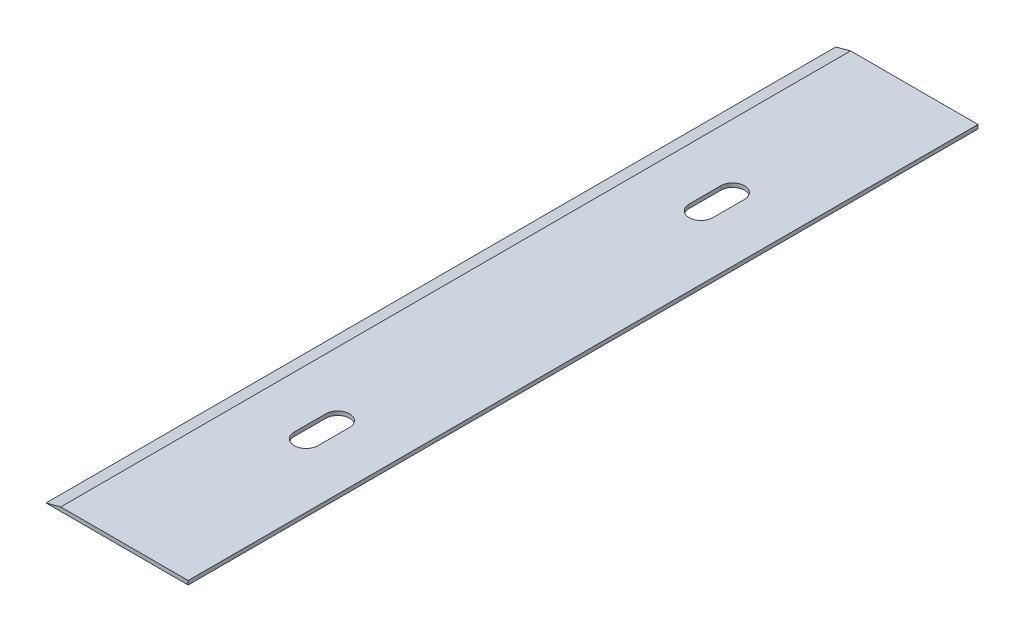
from build123d import *

# Parameters (mm, degrees)
SALIENTE_EXTRUIR1_DEPTH = 100
CORTAR_EXTRUIR1_DEPTH   = 102.608316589


with BuildPart() as part:
    # Croquis1 → Saliente-Extruir1 (new body)
    with BuildSketch(Plane.XY):
        Polygon((0, 0), (1.866025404, 0.5), (18, 0.5), (18, 0), align=None)
    extrude(amount=-SALIENTE_EXTRUIR1_DEPTH)

    # Croquis2 → Cortar-Extruir1 (cut, through all)
    with BuildSketch(Plane(origin=(0, 0.5, 0), x_dir=(1, 0, 0), z_dir=(0, 1, 0))):
        with BuildLine():
            Line((11.433012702, 77), (11.433012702, 73))
            ThreePointArc((11.433012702, 73), (9.933012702, 71.5), (8.433012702, 73))
            Line((8.433012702, 73), (8.433012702, 77))
            ThreePointArc((8.433012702, 77), (9.933012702, 78.5), (11.433012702, 77))
        make_face()
    cortar_extruir1 = extrude(amount=-CORTAR_EXTRUIR1_DEPTH, mode=Mode.SUBTRACT)

    # Simetr_a1: Cortar-Extruir1 across plane
    add(cortar_extruir1.mirror(Plane.XY.offset(-50)), mode=Mode.SUBTRACT)


solid = part.part
